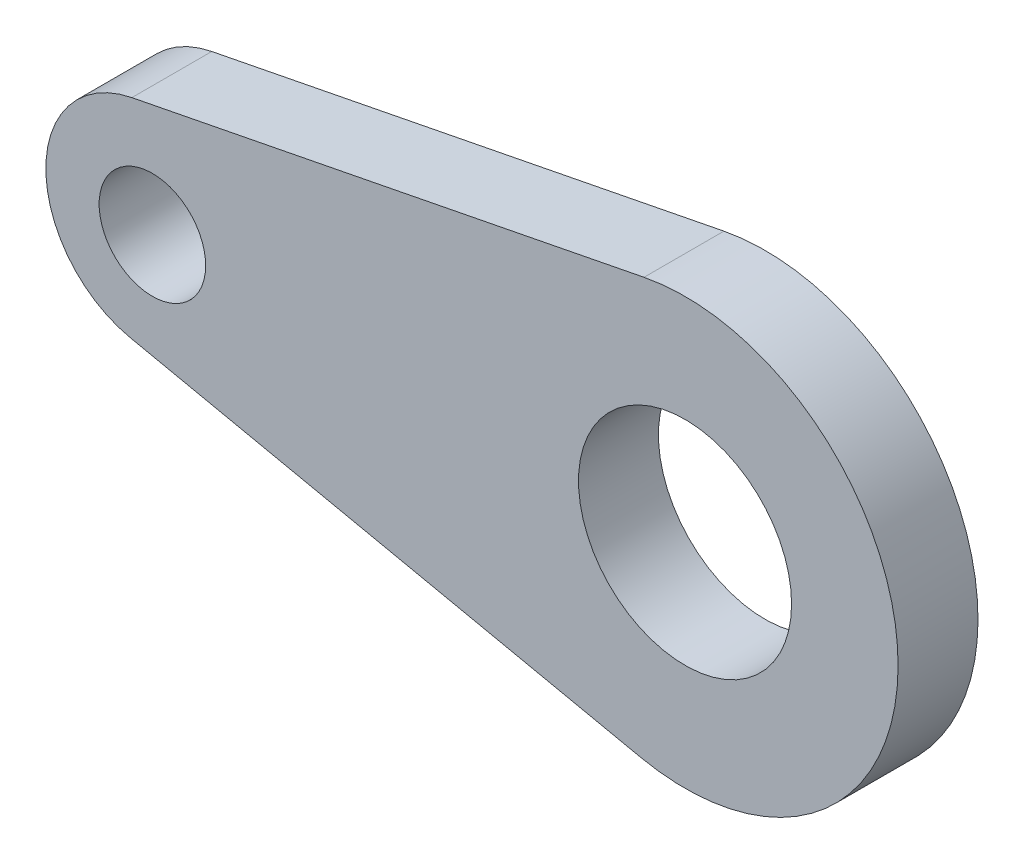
ISO-10303-21;
HEADER;
FILE_DESCRIPTION(('STEP AP214'),'2;1');
FILE_NAME('part.step','',(''),(''),'','','');
FILE_SCHEMA(('AUTOMOTIVE_DESIGN { 1 0 10303 214 1 1 1 1 }'));
ENDSEC;
DATA;
#1=APPLICATION_CONTEXT('core data for automotive mechanical design processes');
#2=APPLICATION_PROTOCOL_DEFINITION('international standard','automotive_design',2000,#1);
#3=PRODUCT_CONTEXT('',#1,'mechanical');
#4=PRODUCT('Part','Part','',(#3));
#5=PRODUCT_RELATED_PRODUCT_CATEGORY('part','',(#4));
#6=PRODUCT_DEFINITION_FORMATION('','',#4);
#7=PRODUCT_DEFINITION_CONTEXT('part definition',#1,'design');
#8=PRODUCT_DEFINITION('design','',#6,#7);
#9=PRODUCT_DEFINITION_SHAPE('','',#8);
#10=(LENGTH_UNIT() NAMED_UNIT(*) SI_UNIT(.MILLI.,.METRE.));
#11=(NAMED_UNIT(*) PLANE_ANGLE_UNIT() SI_UNIT($,.RADIAN.));
#12=(NAMED_UNIT(*) SI_UNIT($,.STERADIAN.) SOLID_ANGLE_UNIT());
#13=UNCERTAINTY_MEASURE_WITH_UNIT(LENGTH_MEASURE(1.E-05),#10,'distance_accuracy_value','');
#14=(GEOMETRIC_REPRESENTATION_CONTEXT(3) GLOBAL_UNCERTAINTY_ASSIGNED_CONTEXT((#13)) GLOBAL_UNIT_ASSIGNED_CONTEXT((#10,
#11,#12)) REPRESENTATION_CONTEXT('',''));
#15=CARTESIAN_POINT('',(0.,0.,0.));
#16=DIRECTION('',(0.,0.,1.));
#17=DIRECTION('',(1.,0.,0.));
#18=AXIS2_PLACEMENT_3D('',#15,#16,#17);
#19=CARTESIAN_POINT('',(-3.9944358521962,-18.8351695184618,15.));
#20=DIRECTION('',(0.207459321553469,0.978243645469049,0.));
#21=DIRECTION('',(-0.978243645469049,0.207459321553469,0.));
#22=AXIS2_PLACEMENT_3D('',#19,#20,#21);
#23=PLANE('',#22);
#24=DIRECTION('',(0.978243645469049,-0.207459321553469,0.));
#25=VECTOR('',#24,1.);
#26=CARTESIAN_POINT('',(-3.9944358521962,-18.8351695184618,0.));
#27=LINE('',#26,#25);
#28=CARTESIAN_POINT('',(-4.14918643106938,-18.8023510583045,0.));
#29=VERTEX_POINT('',#28);
#30=CARTESIAN_POINT('',(91.7016271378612,-39.129745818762,0.));
#31=VERTEX_POINT('',#30);
#32=EDGE_CURVE('E121',#29,#31,#27,.T.);
#33=ORIENTED_EDGE('',*,*,#32,.T.);
#34=DIRECTION('',(0.,0.,-1.));
#35=VECTOR('',#34,1.);
#36=CARTESIAN_POINT('',(91.7016271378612,-39.129745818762,15.));
#37=LINE('',#36,#35);
#38=CARTESIAN_POINT('',(91.7016271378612,-39.129745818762,15.));
#39=VERTEX_POINT('',#38);
#40=EDGE_CURVE('E11',#39,#31,#37,.T.);
#41=ORIENTED_EDGE('',*,*,#40,.F.);
#42=DIRECTION('',(0.978243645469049,-0.207459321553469,0.));
#43=VECTOR('',#42,1.);
#44=CARTESIAN_POINT('',(-3.9944358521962,-18.8351695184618,15.));
#45=LINE('',#44,#43);
#46=CARTESIAN_POINT('',(-4.14918643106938,-18.8023510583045,15.));
#47=VERTEX_POINT('',#46);
#48=EDGE_CURVE('E94',#47,#39,#45,.T.);
#49=ORIENTED_EDGE('',*,*,#48,.F.);
#50=DIRECTION('',(0.,0.,-1.));
#51=VECTOR('',#50,1.);
#52=CARTESIAN_POINT('',(-4.14918643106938,-18.8023510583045,15.));
#53=LINE('',#52,#51);
#54=EDGE_CURVE('E109',#47,#29,#53,.T.);
#55=ORIENTED_EDGE('',*,*,#54,.T.);
#56=EDGE_LOOP('',(#33,#41,#49,#55));
#57=FACE_BOUND('',#56,.T.);
#58=ADVANCED_FACE('F45',(#57),#23,.F.);
#59=CARTESIAN_POINT('',(100.,0.,15.));
#60=DIRECTION('',(0.,0.,-1.));
#61=DIRECTION('',(-1.,0.,0.));
#62=AXIS2_PLACEMENT_3D('',#59,#60,#61);
#63=CYLINDRICAL_SURFACE('',#62,40.);
#64=CARTESIAN_POINT('',(100.,0.,0.));
#65=DIRECTION('',(0.,0.,1.));
#66=DIRECTION('',(1.,0.,0.));
#67=AXIS2_PLACEMENT_3D('',#64,#65,#66);
#68=CIRCLE('',#67,40.);
#69=CARTESIAN_POINT('',(92.2993031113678,39.2517422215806,0.));
#70=VERTEX_POINT('',#69);
#71=EDGE_CURVE('E100',#31,#70,#68,.T.);
#72=ORIENTED_EDGE('',*,*,#71,.T.);
#73=DIRECTION('',(0.,0.,-1.));
#74=VECTOR('',#73,1.);
#75=CARTESIAN_POINT('',(92.2993031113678,39.2517422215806,15.));
#76=LINE('',#75,#74);
#77=CARTESIAN_POINT('',(92.2993031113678,39.2517422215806,15.));
#78=VERTEX_POINT('',#77);
#79=EDGE_CURVE('E55',#78,#70,#76,.T.);
#80=ORIENTED_EDGE('',*,*,#79,.F.);
#81=CARTESIAN_POINT('',(100.,0.,15.));
#82=DIRECTION('',(0.,0.,1.));
#83=DIRECTION('',(1.,0.,0.));
#84=AXIS2_PLACEMENT_3D('',#81,#82,#83);
#85=CIRCLE('',#84,40.);
#86=EDGE_CURVE('E89',#39,#78,#85,.T.);
#87=ORIENTED_EDGE('',*,*,#86,.F.);
#88=ORIENTED_EDGE('',*,*,#40,.T.);
#89=EDGE_LOOP('',(#72,#80,#87,#88));
#90=FACE_BOUND('',#89,.T.);
#91=ADVANCED_FACE('F99',(#90),#63,.T.);
#92=CARTESIAN_POINT('',(-3.99440110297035,20.3601316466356,15.));
#93=DIRECTION('',(-0.192517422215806,0.981293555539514,0.));
#94=DIRECTION('',(-0.981293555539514,-0.192517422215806,0.));
#95=AXIS2_PLACEMENT_3D('',#92,#93,#94);
#96=PLANE('',#95);
#97=DIRECTION('',(0.981293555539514,0.192517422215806,0.));
#98=VECTOR('',#97,1.);
#99=CARTESIAN_POINT('',(-3.99440110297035,20.3601316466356,0.));
#100=LINE('',#99,#98);
#101=CARTESIAN_POINT('',(-3.85034844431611,20.3883929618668,0.));
#102=VERTEX_POINT('',#101);
#103=EDGE_CURVE('E127',#102,#70,#100,.T.);
#104=ORIENTED_EDGE('',*,*,#103,.F.);
#105=DIRECTION('',(0.,0.,-1.));
#106=VECTOR('',#105,1.);
#107=CARTESIAN_POINT('',(-3.85034844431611,20.3883929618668,15.));
#108=LINE('',#107,#106);
#109=CARTESIAN_POINT('',(-3.85034844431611,20.3883929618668,15.));
#110=VERTEX_POINT('',#109);
#111=EDGE_CURVE('E79',#110,#102,#108,.T.);
#112=ORIENTED_EDGE('',*,*,#111,.F.);
#113=DIRECTION('',(0.981293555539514,0.192517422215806,0.));
#114=VECTOR('',#113,1.);
#115=CARTESIAN_POINT('',(-3.99440110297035,20.3601316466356,15.));
#116=LINE('',#115,#114);
#117=EDGE_CURVE('E92',#110,#78,#116,.T.);
#118=ORIENTED_EDGE('',*,*,#117,.T.);
#119=ORIENTED_EDGE('',*,*,#79,.T.);
#120=EDGE_LOOP('',(#104,#112,#118,#119));
#121=FACE_BOUND('',#120,.T.);
#122=ADVANCED_FACE('F105',(#121),#96,.T.);
#123=CARTESIAN_POINT('',(0.,0.,15.));
#124=DIRECTION('',(0.,0.,-1.));
#125=DIRECTION('',(-1.,0.,0.));
#126=AXIS2_PLACEMENT_3D('',#123,#124,#125);
#127=CYLINDRICAL_SURFACE('',#126,10.);
#128=CARTESIAN_POINT('',(0.,0.,15.));
#129=DIRECTION('',(0.,0.,1.));
#130=DIRECTION('',(1.,0.,0.));
#131=AXIS2_PLACEMENT_3D('',#128,#129,#130);
#132=CIRCLE('',#131,10.);
#133=CARTESIAN_POINT('',(10.,0.,15.));
#134=VERTEX_POINT('',#133);
#135=EDGE_CURVE('E169',#134,#134,#132,.T.);
#136=ORIENTED_EDGE('',*,*,#135,.T.);
#137=EDGE_LOOP('',(#136));
#138=FACE_BOUND('',#137,.T.);
#139=CARTESIAN_POINT('',(0.,0.,0.));
#140=DIRECTION('',(0.,0.,1.));
#141=DIRECTION('',(1.,0.,0.));
#142=AXIS2_PLACEMENT_3D('',#139,#140,#141);
#143=CIRCLE('',#142,10.);
#144=CARTESIAN_POINT('',(10.,0.,0.));
#145=VERTEX_POINT('',#144);
#146=EDGE_CURVE('E117',#145,#145,#143,.T.);
#147=ORIENTED_EDGE('',*,*,#146,.F.);
#148=EDGE_LOOP('',(#147));
#149=FACE_BOUND('',#148,.T.);
#150=ADVANCED_FACE('F158',(#138,#149),#127,.F.);
#151=CARTESIAN_POINT('',(100.,0.,15.));
#152=DIRECTION('',(0.,0.,-1.));
#153=DIRECTION('',(-1.,0.,0.));
#154=AXIS2_PLACEMENT_3D('',#151,#152,#153);
#155=CYLINDRICAL_SURFACE('',#154,20.);
#156=CARTESIAN_POINT('',(100.,0.,15.));
#157=DIRECTION('',(0.,0.,1.));
#158=DIRECTION('',(1.,0.,0.));
#159=AXIS2_PLACEMENT_3D('',#156,#157,#158);
#160=CIRCLE('',#159,20.);
#161=CARTESIAN_POINT('',(120.,0.,15.));
#162=VERTEX_POINT('',#161);
#163=EDGE_CURVE('E132',#162,#162,#160,.T.);
#164=ORIENTED_EDGE('',*,*,#163,.T.);
#165=EDGE_LOOP('',(#164));
#166=FACE_BOUND('',#165,.T.);
#167=CARTESIAN_POINT('',(100.,0.,0.));
#168=DIRECTION('',(0.,0.,1.));
#169=DIRECTION('',(1.,0.,0.));
#170=AXIS2_PLACEMENT_3D('',#167,#168,#169);
#171=CIRCLE('',#170,20.);
#172=CARTESIAN_POINT('',(120.,0.,0.));
#173=VERTEX_POINT('',#172);
#174=EDGE_CURVE('E113',#173,#173,#171,.T.);
#175=ORIENTED_EDGE('',*,*,#174,.F.);
#176=EDGE_LOOP('',(#175));
#177=FACE_BOUND('',#176,.T.);
#178=ADVANCED_FACE('F47',(#166,#177),#155,.F.);
#179=CARTESIAN_POINT('',(0.,0.762521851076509,15.));
#180=DIRECTION('',(0.,0.,-1.));
#181=DIRECTION('',(-1.,0.,0.));
#182=AXIS2_PLACEMENT_3D('',#179,#180,#181);
#183=CYLINDRICAL_SURFACE('',#182,20.);
#184=CARTESIAN_POINT('',(0.,0.762521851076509,0.));
#185=DIRECTION('',(0.,0.,1.));
#186=DIRECTION('',(1.,0.,0.));
#187=AXIS2_PLACEMENT_3D('',#184,#185,#186);
#188=CIRCLE('',#187,20.);
#189=EDGE_CURVE('E82',#102,#29,#188,.T.);
#190=ORIENTED_EDGE('',*,*,#189,.T.);
#191=ORIENTED_EDGE('',*,*,#54,.F.);
#192=CARTESIAN_POINT('',(0.,0.762521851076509,15.));
#193=DIRECTION('',(0.,0.,1.));
#194=DIRECTION('',(1.,0.,0.));
#195=AXIS2_PLACEMENT_3D('',#192,#193,#194);
#196=CIRCLE('',#195,20.);
#197=EDGE_CURVE('E63',#110,#47,#196,.T.);
#198=ORIENTED_EDGE('',*,*,#197,.F.);
#199=ORIENTED_EDGE('',*,*,#111,.T.);
#200=EDGE_LOOP('',(#190,#191,#198,#199));
#201=FACE_BOUND('',#200,.T.);
#202=ADVANCED_FACE('F146',(#201),#183,.T.);
#203=CARTESIAN_POINT('',(0.,0.,15.));
#204=DIRECTION('',(0.,0.,1.));
#205=DIRECTION('',(1.,0.,0.));
#206=AXIS2_PLACEMENT_3D('',#203,#204,#205);
#207=PLANE('',#206);
#208=ORIENTED_EDGE('',*,*,#163,.F.);
#209=EDGE_LOOP('',(#208));
#210=FACE_BOUND('',#209,.T.);
#211=ORIENTED_EDGE('',*,*,#135,.F.);
#212=EDGE_LOOP('',(#211));
#213=FACE_BOUND('',#212,.T.);
#214=ORIENTED_EDGE('',*,*,#48,.T.);
#215=ORIENTED_EDGE('',*,*,#86,.T.);
#216=ORIENTED_EDGE('',*,*,#117,.F.);
#217=ORIENTED_EDGE('',*,*,#197,.T.);
#218=EDGE_LOOP('',(#214,#215,#216,#217));
#219=FACE_BOUND('',#218,.T.);
#220=ADVANCED_FACE('F90',(#210,#213,#219),#207,.T.);
#221=CARTESIAN_POINT('',(0.,0.,0.));
#222=DIRECTION('',(0.,0.,1.));
#223=DIRECTION('',(1.,0.,0.));
#224=AXIS2_PLACEMENT_3D('',#221,#222,#223);
#225=PLANE('',#224);
#226=ORIENTED_EDGE('',*,*,#174,.T.);
#227=EDGE_LOOP('',(#226));
#228=FACE_BOUND('',#227,.T.);
#229=ORIENTED_EDGE('',*,*,#146,.T.);
#230=EDGE_LOOP('',(#229));
#231=FACE_BOUND('',#230,.T.);
#232=ORIENTED_EDGE('',*,*,#32,.F.);
#233=ORIENTED_EDGE('',*,*,#189,.F.);
#234=ORIENTED_EDGE('',*,*,#103,.T.);
#235=ORIENTED_EDGE('',*,*,#71,.F.);
#236=EDGE_LOOP('',(#232,#233,#234,#235));
#237=FACE_BOUND('',#236,.T.);
#238=ADVANCED_FACE('F139',(#228,#231,#237),#225,.F.);
#239=CLOSED_SHELL('',(#58,#91,#122,#150,#178,#202,#220,#238));
#240=MANIFOLD_SOLID_BREP('B2',#239);
#241=ADVANCED_BREP_SHAPE_REPRESENTATION('',(#18,#240),#14);
#242=SHAPE_DEFINITION_REPRESENTATION(#9,#241);
ENDSEC;
END-ISO-10303-21;
